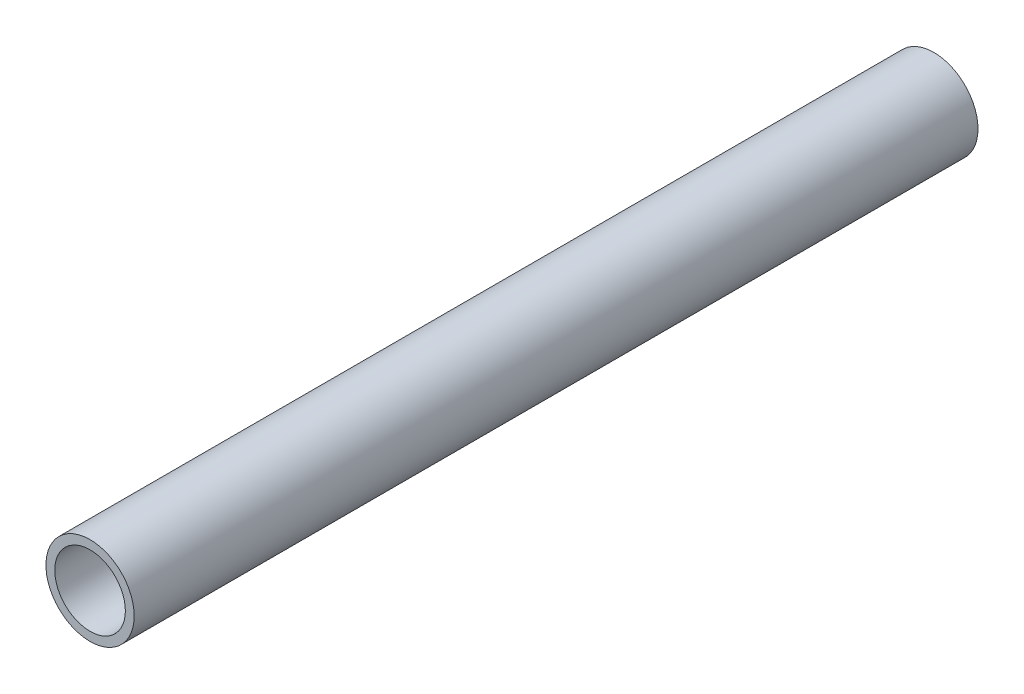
ISO-10303-21;
HEADER;
FILE_DESCRIPTION(('STEP AP214'),'2;1');
FILE_NAME('part.step','',(''),(''),'','','');
FILE_SCHEMA(('AUTOMOTIVE_DESIGN { 1 0 10303 214 1 1 1 1 }'));
ENDSEC;
DATA;
#1=APPLICATION_CONTEXT('core data for automotive mechanical design processes');
#2=APPLICATION_PROTOCOL_DEFINITION('international standard','automotive_design',2000,#1);
#3=PRODUCT_CONTEXT('',#1,'mechanical');
#4=PRODUCT('Part','Part','',(#3));
#5=PRODUCT_RELATED_PRODUCT_CATEGORY('part','',(#4));
#6=PRODUCT_DEFINITION_FORMATION('','',#4);
#7=PRODUCT_DEFINITION_CONTEXT('part definition',#1,'design');
#8=PRODUCT_DEFINITION('design','',#6,#7);
#9=PRODUCT_DEFINITION_SHAPE('','',#8);
#10=(LENGTH_UNIT() NAMED_UNIT(*) SI_UNIT(.MILLI.,.METRE.));
#11=(NAMED_UNIT(*) PLANE_ANGLE_UNIT() SI_UNIT($,.RADIAN.));
#12=(NAMED_UNIT(*) SI_UNIT($,.STERADIAN.) SOLID_ANGLE_UNIT());
#13=UNCERTAINTY_MEASURE_WITH_UNIT(LENGTH_MEASURE(1.E-05),#10,'distance_accuracy_value','');
#14=(GEOMETRIC_REPRESENTATION_CONTEXT(3) GLOBAL_UNCERTAINTY_ASSIGNED_CONTEXT((#13)) GLOBAL_UNIT_ASSIGNED_CONTEXT((#10,
#11,#12)) REPRESENTATION_CONTEXT('',''));
#15=CARTESIAN_POINT('',(0.,0.,0.));
#16=DIRECTION('',(0.,0.,1.));
#17=DIRECTION('',(1.,0.,0.));
#18=AXIS2_PLACEMENT_3D('',#15,#16,#17);
#19=CARTESIAN_POINT('',(0.,0.,9.56));
#20=DIRECTION('',(0.,0.,1.));
#21=DIRECTION('',(1.,0.,0.));
#22=AXIS2_PLACEMENT_3D('',#19,#20,#21);
#23=PLANE('',#22);
#24=CARTESIAN_POINT('',(0.,0.,9.56));
#25=DIRECTION('',(0.,0.,1.));
#26=DIRECTION('',(1.,0.,0.));
#27=AXIS2_PLACEMENT_3D('',#24,#25,#26);
#28=CIRCLE('',#27,0.5);
#29=CARTESIAN_POINT('',(0.5,0.,9.56));
#30=VERTEX_POINT('',#29);
#31=EDGE_CURVE('E10',#30,#30,#28,.T.);
#32=ORIENTED_EDGE('',*,*,#31,.T.);
#33=EDGE_LOOP('',(#32));
#34=FACE_BOUND('',#33,.T.);
#35=CARTESIAN_POINT('',(0.,0.,9.56));
#36=DIRECTION('',(0.,0.,1.));
#37=DIRECTION('',(1.,0.,0.));
#38=AXIS2_PLACEMENT_3D('',#35,#36,#37);
#39=CIRCLE('',#38,0.4);
#40=CARTESIAN_POINT('',(0.4,0.,9.56));
#41=VERTEX_POINT('',#40);
#42=EDGE_CURVE('E40',#41,#41,#39,.T.);
#43=ORIENTED_EDGE('',*,*,#42,.F.);
#44=EDGE_LOOP('',(#43));
#45=FACE_BOUND('',#44,.T.);
#46=ADVANCED_FACE('F29',(#34,#45),#23,.T.);
#47=CARTESIAN_POINT('',(0.,0.,0.));
#48=DIRECTION('',(0.,0.,1.));
#49=DIRECTION('',(1.,0.,0.));
#50=AXIS2_PLACEMENT_3D('',#47,#48,#49);
#51=PLANE('',#50);
#52=CARTESIAN_POINT('',(0.,0.,0.));
#53=DIRECTION('',(0.,0.,1.));
#54=DIRECTION('',(1.,0.,0.));
#55=AXIS2_PLACEMENT_3D('',#52,#53,#54);
#56=CIRCLE('',#55,0.5);
#57=CARTESIAN_POINT('',(0.5,0.,0.));
#58=VERTEX_POINT('',#57);
#59=EDGE_CURVE('E33',#58,#58,#56,.T.);
#60=ORIENTED_EDGE('',*,*,#59,.F.);
#61=EDGE_LOOP('',(#60));
#62=FACE_BOUND('',#61,.T.);
#63=CARTESIAN_POINT('',(0.,0.,0.));
#64=DIRECTION('',(0.,0.,1.));
#65=DIRECTION('',(1.,0.,0.));
#66=AXIS2_PLACEMENT_3D('',#63,#64,#65);
#67=CIRCLE('',#66,0.4);
#68=CARTESIAN_POINT('',(0.4,0.,0.));
#69=VERTEX_POINT('',#68);
#70=EDGE_CURVE('E42',#69,#69,#67,.T.);
#71=ORIENTED_EDGE('',*,*,#70,.T.);
#72=EDGE_LOOP('',(#71));
#73=FACE_BOUND('',#72,.T.);
#74=ADVANCED_FACE('F52',(#62,#73),#51,.F.);
#75=CARTESIAN_POINT('',(0.,0.,9.56));
#76=DIRECTION('',(0.,0.,-1.));
#77=DIRECTION('',(-1.,0.,0.));
#78=AXIS2_PLACEMENT_3D('',#75,#76,#77);
#79=CYLINDRICAL_SURFACE('',#78,0.5);
#80=ORIENTED_EDGE('',*,*,#31,.F.);
#81=EDGE_LOOP('',(#80));
#82=FACE_BOUND('',#81,.T.);
#83=ORIENTED_EDGE('',*,*,#59,.T.);
#84=EDGE_LOOP('',(#83));
#85=FACE_BOUND('',#84,.T.);
#86=ADVANCED_FACE('F31',(#82,#85),#79,.T.);
#87=CARTESIAN_POINT('',(0.,0.,9.56));
#88=DIRECTION('',(0.,0.,-1.));
#89=DIRECTION('',(-1.,0.,0.));
#90=AXIS2_PLACEMENT_3D('',#87,#88,#89);
#91=CYLINDRICAL_SURFACE('',#90,0.4);
#92=ORIENTED_EDGE('',*,*,#42,.T.);
#93=EDGE_LOOP('',(#92));
#94=FACE_BOUND('',#93,.T.);
#95=ORIENTED_EDGE('',*,*,#70,.F.);
#96=EDGE_LOOP('',(#95));
#97=FACE_BOUND('',#96,.T.);
#98=ADVANCED_FACE('F48',(#94,#97),#91,.F.);
#99=CLOSED_SHELL('',(#46,#74,#86,#98));
#100=MANIFOLD_SOLID_BREP('B2',#99);
#101=ADVANCED_BREP_SHAPE_REPRESENTATION('',(#18,#100),#14);
#102=SHAPE_DEFINITION_REPRESENTATION(#9,#101);
ENDSEC;
END-ISO-10303-21;
